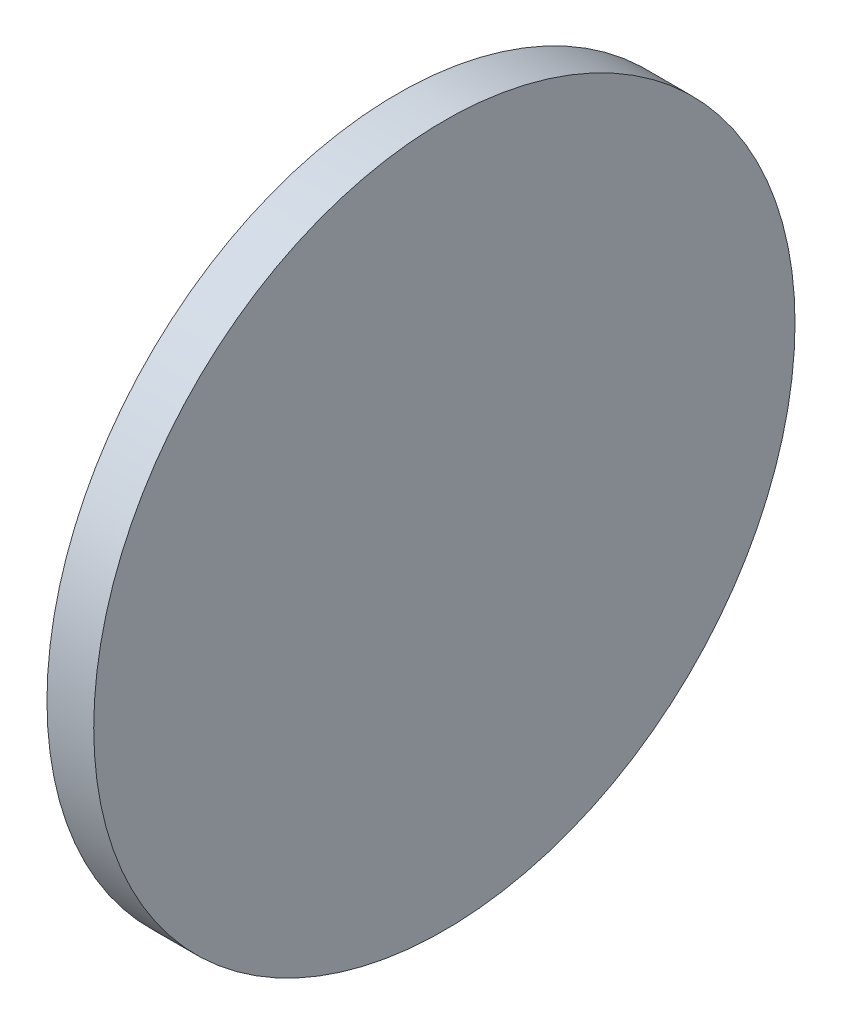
ISO-10303-21;
HEADER;
FILE_DESCRIPTION(('STEP AP214'),'2;1');
FILE_NAME('part.step','',(''),(''),'','','');
FILE_SCHEMA(('AUTOMOTIVE_DESIGN { 1 0 10303 214 1 1 1 1 }'));
ENDSEC;
DATA;
#1=APPLICATION_CONTEXT('core data for automotive mechanical design processes');
#2=APPLICATION_PROTOCOL_DEFINITION('international standard','automotive_design',2000,#1);
#3=PRODUCT_CONTEXT('',#1,'mechanical');
#4=PRODUCT('Part','Part','',(#3));
#5=PRODUCT_RELATED_PRODUCT_CATEGORY('part','',(#4));
#6=PRODUCT_DEFINITION_FORMATION('','',#4);
#7=PRODUCT_DEFINITION_CONTEXT('part definition',#1,'design');
#8=PRODUCT_DEFINITION('design','',#6,#7);
#9=PRODUCT_DEFINITION_SHAPE('','',#8);
#10=(LENGTH_UNIT() NAMED_UNIT(*) SI_UNIT(.MILLI.,.METRE.));
#11=(NAMED_UNIT(*) PLANE_ANGLE_UNIT() SI_UNIT($,.RADIAN.));
#12=(NAMED_UNIT(*) SI_UNIT($,.STERADIAN.) SOLID_ANGLE_UNIT());
#13=UNCERTAINTY_MEASURE_WITH_UNIT(LENGTH_MEASURE(1.E-05),#10,'distance_accuracy_value','');
#14=(GEOMETRIC_REPRESENTATION_CONTEXT(3) GLOBAL_UNCERTAINTY_ASSIGNED_CONTEXT((#13)) GLOBAL_UNIT_ASSIGNED_CONTEXT((#10,
#11,#12)) REPRESENTATION_CONTEXT('',''));
#15=CARTESIAN_POINT('',(0.,0.,0.));
#16=DIRECTION('',(0.,0.,1.));
#17=DIRECTION('',(1.,0.,0.));
#18=AXIS2_PLACEMENT_3D('',#15,#16,#17);
#19=CARTESIAN_POINT('',(2.27,0.,0.));
#20=DIRECTION('',(-1.,0.,0.));
#21=DIRECTION('',(0.,0.,1.));
#22=AXIS2_PLACEMENT_3D('',#19,#20,#21);
#23=CYLINDRICAL_SURFACE('',#22,9.525);
#24=CARTESIAN_POINT('',(2.27,0.,0.));
#25=DIRECTION('',(1.,0.,0.));
#26=DIRECTION('',(0.,0.,-1.));
#27=AXIS2_PLACEMENT_3D('',#24,#25,#26);
#28=CIRCLE('',#27,9.525);
#29=CARTESIAN_POINT('',(2.27,0.,-9.525));
#30=VERTEX_POINT('',#29);
#31=EDGE_CURVE('E10',#30,#30,#28,.T.);
#32=ORIENTED_EDGE('',*,*,#31,.F.);
#33=EDGE_LOOP('',(#32));
#34=FACE_BOUND('',#33,.T.);
#35=CARTESIAN_POINT('',(1.,0.,0.));
#36=DIRECTION('',(1.,0.,0.));
#37=DIRECTION('',(0.,0.,-1.));
#38=AXIS2_PLACEMENT_3D('',#35,#36,#37);
#39=CIRCLE('',#38,9.525);
#40=CARTESIAN_POINT('',(1.,0.,-9.525));
#41=VERTEX_POINT('',#40);
#42=EDGE_CURVE('E46',#41,#41,#39,.T.);
#43=ORIENTED_EDGE('',*,*,#42,.T.);
#44=EDGE_LOOP('',(#43));
#45=FACE_BOUND('',#44,.T.);
#46=ADVANCED_FACE('F43',(#34,#45),#23,.T.);
#47=CARTESIAN_POINT('',(2.27,0.,0.));
#48=DIRECTION('',(1.,0.,0.));
#49=DIRECTION('',(0.,0.,-1.));
#50=AXIS2_PLACEMENT_3D('',#47,#48,#49);
#51=PLANE('',#50);
#52=ORIENTED_EDGE('',*,*,#31,.T.);
#53=EDGE_LOOP('',(#52));
#54=FACE_BOUND('',#53,.T.);
#55=ADVANCED_FACE('F58',(#54),#51,.T.);
#56=CARTESIAN_POINT('',(1.,0.,0.));
#57=DIRECTION('',(1.,0.,0.));
#58=DIRECTION('',(0.,0.,-1.));
#59=AXIS2_PLACEMENT_3D('',#56,#57,#58);
#60=PLANE('',#59);
#61=ORIENTED_EDGE('',*,*,#42,.F.);
#62=EDGE_LOOP('',(#61));
#63=FACE_BOUND('',#62,.T.);
#64=ADVANCED_FACE('F56',(#63),#60,.F.);
#65=CLOSED_SHELL('',(#46,#55,#64));
#66=MANIFOLD_SOLID_BREP('B2',#65);
#67=ADVANCED_BREP_SHAPE_REPRESENTATION('',(#18,#66),#14);
#68=SHAPE_DEFINITION_REPRESENTATION(#9,#67);
ENDSEC;
END-ISO-10303-21;
